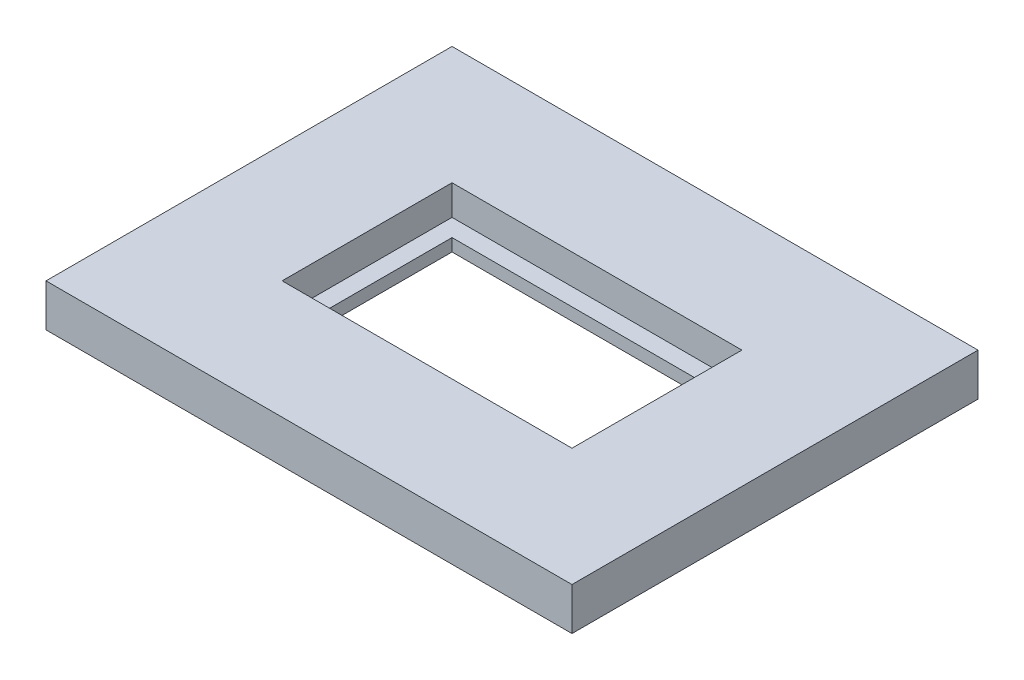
ISO-10303-21;
HEADER;
FILE_DESCRIPTION(('STEP AP214'),'2;1');
FILE_NAME('part.step','',(''),(''),'','','');
FILE_SCHEMA(('AUTOMOTIVE_DESIGN { 1 0 10303 214 1 1 1 1 }'));
ENDSEC;
DATA;
#1=APPLICATION_CONTEXT('core data for automotive mechanical design processes');
#2=APPLICATION_PROTOCOL_DEFINITION('international standard','automotive_design',2000,#1);
#3=PRODUCT_CONTEXT('',#1,'mechanical');
#4=PRODUCT('Part','Part','',(#3));
#5=PRODUCT_RELATED_PRODUCT_CATEGORY('part','',(#4));
#6=PRODUCT_DEFINITION_FORMATION('','',#4);
#7=PRODUCT_DEFINITION_CONTEXT('part definition',#1,'design');
#8=PRODUCT_DEFINITION('design','',#6,#7);
#9=PRODUCT_DEFINITION_SHAPE('','',#8);
#10=(LENGTH_UNIT() NAMED_UNIT(*) SI_UNIT(.MILLI.,.METRE.));
#11=(NAMED_UNIT(*) PLANE_ANGLE_UNIT() SI_UNIT($,.RADIAN.));
#12=(NAMED_UNIT(*) SI_UNIT($,.STERADIAN.) SOLID_ANGLE_UNIT());
#13=UNCERTAINTY_MEASURE_WITH_UNIT(LENGTH_MEASURE(1.E-05),#10,'distance_accuracy_value','');
#14=(GEOMETRIC_REPRESENTATION_CONTEXT(3) GLOBAL_UNCERTAINTY_ASSIGNED_CONTEXT((#13)) GLOBAL_UNIT_ASSIGNED_CONTEXT((#10,
#11,#12)) REPRESENTATION_CONTEXT('',''));
#15=CARTESIAN_POINT('',(0.,0.,0.));
#16=DIRECTION('',(0.,0.,1.));
#17=DIRECTION('',(1.,0.,0.));
#18=AXIS2_PLACEMENT_3D('',#15,#16,#17);
#19=CARTESIAN_POINT('',(0.,19.05,0.));
#20=DIRECTION('',(0.,1.,0.));
#21=DIRECTION('',(0.,0.,1.));
#22=AXIS2_PLACEMENT_3D('',#19,#20,#21);
#23=PLANE('',#22);
#24=DIRECTION('',(0.,0.,1.));
#25=VECTOR('',#24,1.);
#26=CARTESIAN_POINT('',(-167.075,19.05,128.975));
#27=LINE('',#26,#25);
#28=CARTESIAN_POINT('',(-167.075,19.05,-128.975));
#29=VERTEX_POINT('',#28);
#30=CARTESIAN_POINT('',(-167.075,19.05,128.975));
#31=VERTEX_POINT('',#30);
#32=EDGE_CURVE('E206',#29,#31,#27,.T.);
#33=ORIENTED_EDGE('',*,*,#32,.T.);
#34=DIRECTION('',(1.,0.,0.));
#35=VECTOR('',#34,1.);
#36=CARTESIAN_POINT('',(167.075,19.05,128.975));
#37=LINE('',#36,#35);
#38=CARTESIAN_POINT('',(167.075,19.05,128.975));
#39=VERTEX_POINT('',#38);
#40=EDGE_CURVE('E208',#31,#39,#37,.T.);
#41=ORIENTED_EDGE('',*,*,#40,.T.);
#42=DIRECTION('',(0.,0.,-1.));
#43=VECTOR('',#42,1.);
#44=CARTESIAN_POINT('',(167.075,19.05,128.975));
#45=LINE('',#44,#43);
#46=CARTESIAN_POINT('',(167.075,19.05,-128.975));
#47=VERTEX_POINT('',#46);
#48=EDGE_CURVE('E210',#39,#47,#45,.T.);
#49=ORIENTED_EDGE('',*,*,#48,.T.);
#50=DIRECTION('',(-1.,0.,0.));
#51=VECTOR('',#50,1.);
#52=CARTESIAN_POINT('',(167.075,19.05,-128.975));
#53=LINE('',#52,#51);
#54=EDGE_CURVE('E58',#47,#29,#53,.T.);
#55=ORIENTED_EDGE('',*,*,#54,.T.);
#56=EDGE_LOOP('',(#33,#41,#49,#55));
#57=FACE_BOUND('',#56,.T.);
#58=DIRECTION('',(1.,0.,0.));
#59=VECTOR('',#58,1.);
#60=CARTESIAN_POINT('',(92.075,19.05,53.975));
#61=LINE('',#60,#59);
#62=CARTESIAN_POINT('',(-92.075,19.05,53.975));
#63=VERTEX_POINT('',#62);
#64=CARTESIAN_POINT('',(92.075,19.05,53.975));
#65=VERTEX_POINT('',#64);
#66=EDGE_CURVE('E181',#63,#65,#61,.T.);
#67=ORIENTED_EDGE('',*,*,#66,.F.);
#68=DIRECTION('',(0.,0.,1.));
#69=VECTOR('',#68,1.);
#70=CARTESIAN_POINT('',(-92.075,19.05,53.975));
#71=LINE('',#70,#69);
#72=CARTESIAN_POINT('',(-92.075,19.05,-53.975));
#73=VERTEX_POINT('',#72);
#74=EDGE_CURVE('E179',#73,#63,#71,.T.);
#75=ORIENTED_EDGE('',*,*,#74,.F.);
#76=DIRECTION('',(-1.,0.,0.));
#77=VECTOR('',#76,1.);
#78=CARTESIAN_POINT('',(92.075,19.05,-53.975));
#79=LINE('',#78,#77);
#80=CARTESIAN_POINT('',(92.075,19.05,-53.975));
#81=VERTEX_POINT('',#80);
#82=EDGE_CURVE('E186',#81,#73,#79,.T.);
#83=ORIENTED_EDGE('',*,*,#82,.F.);
#84=DIRECTION('',(0.,0.,-1.));
#85=VECTOR('',#84,1.);
#86=CARTESIAN_POINT('',(92.075,19.05,53.975));
#87=LINE('',#86,#85);
#88=EDGE_CURVE('E184',#65,#81,#87,.T.);
#89=ORIENTED_EDGE('',*,*,#88,.F.);
#90=EDGE_LOOP('',(#67,#75,#83,#89));
#91=FACE_BOUND('',#90,.T.);
#92=ADVANCED_FACE('F35',(#57,#91),#23,.T.);
#93=CARTESIAN_POINT('',(-167.075,19.05,128.975));
#94=DIRECTION('',(1.,0.,0.));
#95=DIRECTION('',(0.,0.,-1.));
#96=AXIS2_PLACEMENT_3D('',#93,#94,#95);
#97=PLANE('',#96);
#98=DIRECTION('',(0.,-1.,0.));
#99=VECTOR('',#98,1.);
#100=CARTESIAN_POINT('',(-167.075,19.05,-128.975));
#101=LINE('',#100,#99);
#102=CARTESIAN_POINT('',(-167.075,-7.9375,-128.975));
#103=VERTEX_POINT('',#102);
#104=EDGE_CURVE('E213',#29,#103,#101,.T.);
#105=ORIENTED_EDGE('',*,*,#104,.T.);
#106=DIRECTION('',(0.,0.,-1.));
#107=VECTOR('',#106,1.);
#108=CARTESIAN_POINT('',(-167.075,-7.9375,128.975));
#109=LINE('',#108,#107);
#110=CARTESIAN_POINT('',(-167.075,-7.9375,128.975));
#111=VERTEX_POINT('',#110);
#112=EDGE_CURVE('E143',#111,#103,#109,.T.);
#113=ORIENTED_EDGE('',*,*,#112,.F.);
#114=DIRECTION('',(0.,-1.,0.));
#115=VECTOR('',#114,1.);
#116=CARTESIAN_POINT('',(-167.075,19.05,128.975));
#117=LINE('',#116,#115);
#118=EDGE_CURVE('E11',#31,#111,#117,.T.);
#119=ORIENTED_EDGE('',*,*,#118,.F.);
#120=ORIENTED_EDGE('',*,*,#32,.F.);
#121=EDGE_LOOP('',(#105,#113,#119,#120));
#122=FACE_BOUND('',#121,.T.);
#123=ADVANCED_FACE('F37',(#122),#97,.F.);
#124=CARTESIAN_POINT('',(167.075,19.05,128.975));
#125=DIRECTION('',(0.,0.,-1.));
#126=DIRECTION('',(-1.,0.,0.));
#127=AXIS2_PLACEMENT_3D('',#124,#125,#126);
#128=PLANE('',#127);
#129=ORIENTED_EDGE('',*,*,#118,.T.);
#130=DIRECTION('',(-1.,0.,0.));
#131=VECTOR('',#130,1.);
#132=CARTESIAN_POINT('',(-167.075,-7.9375,128.975));
#133=LINE('',#132,#131);
#134=CARTESIAN_POINT('',(167.075,-7.9375,128.975));
#135=VERTEX_POINT('',#134);
#136=EDGE_CURVE('E175',#135,#111,#133,.T.);
#137=ORIENTED_EDGE('',*,*,#136,.F.);
#138=DIRECTION('',(0.,-1.,0.));
#139=VECTOR('',#138,1.);
#140=CARTESIAN_POINT('',(167.075,19.05,128.975));
#141=LINE('',#140,#139);
#142=EDGE_CURVE('E43',#39,#135,#141,.T.);
#143=ORIENTED_EDGE('',*,*,#142,.F.);
#144=ORIENTED_EDGE('',*,*,#40,.F.);
#145=EDGE_LOOP('',(#129,#137,#143,#144));
#146=FACE_BOUND('',#145,.T.);
#147=ADVANCED_FACE('F227',(#146),#128,.F.);
#148=CARTESIAN_POINT('',(167.075,19.05,128.975));
#149=DIRECTION('',(-1.,0.,0.));
#150=DIRECTION('',(0.,0.,1.));
#151=AXIS2_PLACEMENT_3D('',#148,#149,#150);
#152=PLANE('',#151);
#153=ORIENTED_EDGE('',*,*,#142,.T.);
#154=DIRECTION('',(0.,0.,1.));
#155=VECTOR('',#154,1.);
#156=CARTESIAN_POINT('',(167.075,-7.9375,128.975));
#157=LINE('',#156,#155);
#158=CARTESIAN_POINT('',(167.075,-7.9375,-128.975));
#159=VERTEX_POINT('',#158);
#160=EDGE_CURVE('E172',#159,#135,#157,.T.);
#161=ORIENTED_EDGE('',*,*,#160,.F.);
#162=DIRECTION('',(0.,-1.,0.));
#163=VECTOR('',#162,1.);
#164=CARTESIAN_POINT('',(167.075,19.05,-128.975));
#165=LINE('',#164,#163);
#166=EDGE_CURVE('E215',#47,#159,#165,.T.);
#167=ORIENTED_EDGE('',*,*,#166,.F.);
#168=ORIENTED_EDGE('',*,*,#48,.F.);
#169=EDGE_LOOP('',(#153,#161,#167,#168));
#170=FACE_BOUND('',#169,.T.);
#171=ADVANCED_FACE('F220',(#170),#152,.F.);
#172=CARTESIAN_POINT('',(167.075,19.05,-128.975));
#173=DIRECTION('',(0.,0.,1.));
#174=DIRECTION('',(1.,0.,0.));
#175=AXIS2_PLACEMENT_3D('',#172,#173,#174);
#176=PLANE('',#175);
#177=ORIENTED_EDGE('',*,*,#166,.T.);
#178=DIRECTION('',(1.,0.,0.));
#179=VECTOR('',#178,1.);
#180=CARTESIAN_POINT('',(-167.075,-7.9375,-128.975));
#181=LINE('',#180,#179);
#182=EDGE_CURVE('E169',#103,#159,#181,.T.);
#183=ORIENTED_EDGE('',*,*,#182,.F.);
#184=ORIENTED_EDGE('',*,*,#104,.F.);
#185=ORIENTED_EDGE('',*,*,#54,.F.);
#186=EDGE_LOOP('',(#177,#183,#184,#185));
#187=FACE_BOUND('',#186,.T.);
#188=ADVANCED_FACE('F232',(#187),#176,.F.);
#189=CARTESIAN_POINT('',(-92.075,19.05,53.975));
#190=DIRECTION('',(1.,0.,0.));
#191=DIRECTION('',(0.,0.,-1.));
#192=AXIS2_PLACEMENT_3D('',#189,#190,#191);
#193=PLANE('',#192);
#194=DIRECTION('',(0.,0.,1.));
#195=VECTOR('',#194,1.);
#196=CARTESIAN_POINT('',(-92.075,0.,53.975));
#197=LINE('',#196,#195);
#198=CARTESIAN_POINT('',(-92.075,0.,-53.975));
#199=VERTEX_POINT('',#198);
#200=CARTESIAN_POINT('',(-92.075,0.,53.975));
#201=VERTEX_POINT('',#200);
#202=EDGE_CURVE('E178',#199,#201,#197,.T.);
#203=ORIENTED_EDGE('',*,*,#202,.F.);
#204=DIRECTION('',(0.,-1.,0.));
#205=VECTOR('',#204,1.);
#206=CARTESIAN_POINT('',(-92.075,19.05,-53.975));
#207=LINE('',#206,#205);
#208=EDGE_CURVE('E188',#73,#199,#207,.T.);
#209=ORIENTED_EDGE('',*,*,#208,.F.);
#210=ORIENTED_EDGE('',*,*,#74,.T.);
#211=DIRECTION('',(0.,-1.,0.));
#212=VECTOR('',#211,1.);
#213=CARTESIAN_POINT('',(-92.075,19.05,53.975));
#214=LINE('',#213,#212);
#215=EDGE_CURVE('E203',#63,#201,#214,.T.);
#216=ORIENTED_EDGE('',*,*,#215,.T.);
#217=EDGE_LOOP('',(#203,#209,#210,#216));
#218=FACE_BOUND('',#217,.T.);
#219=ADVANCED_FACE('F234',(#218),#193,.T.);
#220=CARTESIAN_POINT('',(92.075,19.05,53.975));
#221=DIRECTION('',(0.,0.,-1.));
#222=DIRECTION('',(-1.,0.,0.));
#223=AXIS2_PLACEMENT_3D('',#220,#221,#222);
#224=PLANE('',#223);
#225=DIRECTION('',(1.,0.,0.));
#226=VECTOR('',#225,1.);
#227=CARTESIAN_POINT('',(92.075,0.,53.975));
#228=LINE('',#227,#226);
#229=CARTESIAN_POINT('',(92.075,0.,53.975));
#230=VERTEX_POINT('',#229);
#231=EDGE_CURVE('E191',#201,#230,#228,.T.);
#232=ORIENTED_EDGE('',*,*,#231,.F.);
#233=ORIENTED_EDGE('',*,*,#215,.F.);
#234=ORIENTED_EDGE('',*,*,#66,.T.);
#235=DIRECTION('',(0.,-1.,0.));
#236=VECTOR('',#235,1.);
#237=CARTESIAN_POINT('',(92.075,19.05,53.975));
#238=LINE('',#237,#236);
#239=EDGE_CURVE('E201',#65,#230,#238,.T.);
#240=ORIENTED_EDGE('',*,*,#239,.T.);
#241=EDGE_LOOP('',(#232,#233,#234,#240));
#242=FACE_BOUND('',#241,.T.);
#243=ADVANCED_FACE('F240',(#242),#224,.T.);
#244=CARTESIAN_POINT('',(92.075,19.05,53.975));
#245=DIRECTION('',(-1.,0.,0.));
#246=DIRECTION('',(0.,0.,1.));
#247=AXIS2_PLACEMENT_3D('',#244,#245,#246);
#248=PLANE('',#247);
#249=DIRECTION('',(0.,0.,-1.));
#250=VECTOR('',#249,1.);
#251=CARTESIAN_POINT('',(92.075,0.,53.975));
#252=LINE('',#251,#250);
#253=CARTESIAN_POINT('',(92.075,0.,-53.975));
#254=VERTEX_POINT('',#253);
#255=EDGE_CURVE('E194',#230,#254,#252,.T.);
#256=ORIENTED_EDGE('',*,*,#255,.F.);
#257=ORIENTED_EDGE('',*,*,#239,.F.);
#258=ORIENTED_EDGE('',*,*,#88,.T.);
#259=DIRECTION('',(0.,-1.,0.));
#260=VECTOR('',#259,1.);
#261=CARTESIAN_POINT('',(92.075,19.05,-53.975));
#262=LINE('',#261,#260);
#263=EDGE_CURVE('E50',#81,#254,#262,.T.);
#264=ORIENTED_EDGE('',*,*,#263,.T.);
#265=EDGE_LOOP('',(#256,#257,#258,#264));
#266=FACE_BOUND('',#265,.T.);
#267=ADVANCED_FACE('F253',(#266),#248,.T.);
#268=CARTESIAN_POINT('',(92.075,19.05,-53.975));
#269=DIRECTION('',(0.,0.,1.));
#270=DIRECTION('',(1.,0.,0.));
#271=AXIS2_PLACEMENT_3D('',#268,#269,#270);
#272=PLANE('',#271);
#273=DIRECTION('',(-1.,0.,0.));
#274=VECTOR('',#273,1.);
#275=CARTESIAN_POINT('',(92.075,0.,-53.975));
#276=LINE('',#275,#274);
#277=EDGE_CURVE('E182',#254,#199,#276,.T.);
#278=ORIENTED_EDGE('',*,*,#277,.F.);
#279=ORIENTED_EDGE('',*,*,#263,.F.);
#280=ORIENTED_EDGE('',*,*,#82,.T.);
#281=ORIENTED_EDGE('',*,*,#208,.T.);
#282=EDGE_LOOP('',(#278,#279,#280,#281));
#283=FACE_BOUND('',#282,.T.);
#284=ADVANCED_FACE('F257',(#283),#272,.T.);
#285=CARTESIAN_POINT('',(0.,-7.9375,0.));
#286=DIRECTION('',(0.,-1.,0.));
#287=DIRECTION('',(0.,0.,-1.));
#288=AXIS2_PLACEMENT_3D('',#285,#286,#287);
#289=PLANE('',#288);
#290=ORIENTED_EDGE('',*,*,#112,.T.);
#291=ORIENTED_EDGE('',*,*,#182,.T.);
#292=ORIENTED_EDGE('',*,*,#160,.T.);
#293=ORIENTED_EDGE('',*,*,#136,.T.);
#294=EDGE_LOOP('',(#290,#291,#292,#293));
#295=FACE_BOUND('',#294,.T.);
#296=DIRECTION('',(0.,0.,-1.));
#297=VECTOR('',#296,1.);
#298=CARTESIAN_POINT('',(-80.9625,-7.9375,42.8625));
#299=LINE('',#298,#297);
#300=CARTESIAN_POINT('',(-80.9625,-7.9375,42.8625));
#301=VERTEX_POINT('',#300);
#302=CARTESIAN_POINT('',(-80.9625,-7.9375,-42.8625));
#303=VERTEX_POINT('',#302);
#304=EDGE_CURVE('E135',#301,#303,#299,.T.);
#305=ORIENTED_EDGE('',*,*,#304,.F.);
#306=DIRECTION('',(-1.,0.,0.));
#307=VECTOR('',#306,1.);
#308=CARTESIAN_POINT('',(-80.9625,-7.9375,42.8625));
#309=LINE('',#308,#307);
#310=CARTESIAN_POINT('',(80.9625,-7.9375,42.8625));
#311=VERTEX_POINT('',#310);
#312=EDGE_CURVE('E125',#311,#301,#309,.T.);
#313=ORIENTED_EDGE('',*,*,#312,.F.);
#314=DIRECTION('',(0.,0.,1.));
#315=VECTOR('',#314,1.);
#316=CARTESIAN_POINT('',(80.9625,-7.9375,42.8625));
#317=LINE('',#316,#315);
#318=CARTESIAN_POINT('',(80.9625,-7.9375,-42.8625));
#319=VERTEX_POINT('',#318);
#320=EDGE_CURVE('E151',#319,#311,#317,.T.);
#321=ORIENTED_EDGE('',*,*,#320,.F.);
#322=DIRECTION('',(1.,0.,0.));
#323=VECTOR('',#322,1.);
#324=CARTESIAN_POINT('',(-80.9625,-7.9375,-42.8625));
#325=LINE('',#324,#323);
#326=EDGE_CURVE('E149',#303,#319,#325,.T.);
#327=ORIENTED_EDGE('',*,*,#326,.F.);
#328=EDGE_LOOP('',(#305,#313,#321,#327));
#329=FACE_BOUND('',#328,.T.);
#330=ADVANCED_FACE('F147',(#295,#329),#289,.T.);
#331=CARTESIAN_POINT('',(0.,0.,0.));
#332=DIRECTION('',(0.,-1.,0.));
#333=DIRECTION('',(0.,0.,-1.));
#334=AXIS2_PLACEMENT_3D('',#331,#332,#333);
#335=PLANE('',#334);
#336=ORIENTED_EDGE('',*,*,#202,.T.);
#337=ORIENTED_EDGE('',*,*,#231,.T.);
#338=ORIENTED_EDGE('',*,*,#255,.T.);
#339=ORIENTED_EDGE('',*,*,#277,.T.);
#340=EDGE_LOOP('',(#336,#337,#338,#339));
#341=FACE_BOUND('',#340,.T.);
#342=DIRECTION('',(-1.,0.,0.));
#343=VECTOR('',#342,1.);
#344=CARTESIAN_POINT('',(-80.9625,0.,42.8625));
#345=LINE('',#344,#343);
#346=CARTESIAN_POINT('',(80.9625,0.,42.8625));
#347=VERTEX_POINT('',#346);
#348=CARTESIAN_POINT('',(-80.9625,0.,42.8625));
#349=VERTEX_POINT('',#348);
#350=EDGE_CURVE('E155',#347,#349,#345,.T.);
#351=ORIENTED_EDGE('',*,*,#350,.T.);
#352=DIRECTION('',(0.,0.,-1.));
#353=VECTOR('',#352,1.);
#354=CARTESIAN_POINT('',(-80.9625,0.,42.8625));
#355=LINE('',#354,#353);
#356=CARTESIAN_POINT('',(-80.9625,0.,-42.8625));
#357=VERTEX_POINT('',#356);
#358=EDGE_CURVE('E142',#349,#357,#355,.T.);
#359=ORIENTED_EDGE('',*,*,#358,.T.);
#360=DIRECTION('',(1.,0.,0.));
#361=VECTOR('',#360,1.);
#362=CARTESIAN_POINT('',(-80.9625,0.,-42.8625));
#363=LINE('',#362,#361);
#364=CARTESIAN_POINT('',(80.9625,0.,-42.8625));
#365=VERTEX_POINT('',#364);
#366=EDGE_CURVE('E158',#357,#365,#363,.T.);
#367=ORIENTED_EDGE('',*,*,#366,.T.);
#368=DIRECTION('',(0.,0.,1.));
#369=VECTOR('',#368,1.);
#370=CARTESIAN_POINT('',(80.9625,0.,42.8625));
#371=LINE('',#370,#369);
#372=EDGE_CURVE('E136',#365,#347,#371,.T.);
#373=ORIENTED_EDGE('',*,*,#372,.T.);
#374=EDGE_LOOP('',(#351,#359,#367,#373));
#375=FACE_BOUND('',#374,.T.);
#376=ADVANCED_FACE('F261',(#341,#375),#335,.F.);
#377=CARTESIAN_POINT('',(-80.9625,-7.9375,42.8625));
#378=DIRECTION('',(0.,0.,-1.));
#379=DIRECTION('',(-1.,0.,0.));
#380=AXIS2_PLACEMENT_3D('',#377,#378,#379);
#381=PLANE('',#380);
#382=ORIENTED_EDGE('',*,*,#350,.F.);
#383=DIRECTION('',(0.,1.,0.));
#384=VECTOR('',#383,1.);
#385=CARTESIAN_POINT('',(80.9625,-7.9375,42.8625));
#386=LINE('',#385,#384);
#387=EDGE_CURVE('E131',#311,#347,#386,.T.);
#388=ORIENTED_EDGE('',*,*,#387,.F.);
#389=ORIENTED_EDGE('',*,*,#312,.T.);
#390=DIRECTION('',(0.,1.,0.));
#391=VECTOR('',#390,1.);
#392=CARTESIAN_POINT('',(-80.9625,-7.9375,42.8625));
#393=LINE('',#392,#391);
#394=EDGE_CURVE('E128',#301,#349,#393,.T.);
#395=ORIENTED_EDGE('',*,*,#394,.T.);
#396=EDGE_LOOP('',(#382,#388,#389,#395));
#397=FACE_BOUND('',#396,.T.);
#398=ADVANCED_FACE('F127',(#397),#381,.T.);
#399=CARTESIAN_POINT('',(-80.9625,-7.9375,42.8625));
#400=DIRECTION('',(1.,0.,0.));
#401=DIRECTION('',(0.,0.,-1.));
#402=AXIS2_PLACEMENT_3D('',#399,#400,#401);
#403=PLANE('',#402);
#404=ORIENTED_EDGE('',*,*,#358,.F.);
#405=ORIENTED_EDGE('',*,*,#394,.F.);
#406=ORIENTED_EDGE('',*,*,#304,.T.);
#407=DIRECTION('',(0.,1.,0.));
#408=VECTOR('',#407,1.);
#409=CARTESIAN_POINT('',(-80.9625,-7.9375,-42.8625));
#410=LINE('',#409,#408);
#411=EDGE_CURVE('E144',#303,#357,#410,.T.);
#412=ORIENTED_EDGE('',*,*,#411,.T.);
#413=EDGE_LOOP('',(#404,#405,#406,#412));
#414=FACE_BOUND('',#413,.T.);
#415=ADVANCED_FACE('F139',(#414),#403,.T.);
#416=CARTESIAN_POINT('',(-80.9625,-7.9375,-42.8625));
#417=DIRECTION('',(0.,0.,1.));
#418=DIRECTION('',(1.,0.,0.));
#419=AXIS2_PLACEMENT_3D('',#416,#417,#418);
#420=PLANE('',#419);
#421=ORIENTED_EDGE('',*,*,#366,.F.);
#422=ORIENTED_EDGE('',*,*,#411,.F.);
#423=ORIENTED_EDGE('',*,*,#326,.T.);
#424=DIRECTION('',(0.,1.,0.));
#425=VECTOR('',#424,1.);
#426=CARTESIAN_POINT('',(80.9625,-7.9375,-42.8625));
#427=LINE('',#426,#425);
#428=EDGE_CURVE('E164',#319,#365,#427,.T.);
#429=ORIENTED_EDGE('',*,*,#428,.T.);
#430=EDGE_LOOP('',(#421,#422,#423,#429));
#431=FACE_BOUND('',#430,.T.);
#432=ADVANCED_FACE('F271',(#431),#420,.T.);
#433=CARTESIAN_POINT('',(80.9625,-7.9375,42.8625));
#434=DIRECTION('',(-1.,0.,0.));
#435=DIRECTION('',(0.,0.,1.));
#436=AXIS2_PLACEMENT_3D('',#433,#434,#435);
#437=PLANE('',#436);
#438=ORIENTED_EDGE('',*,*,#372,.F.);
#439=ORIENTED_EDGE('',*,*,#428,.F.);
#440=ORIENTED_EDGE('',*,*,#320,.T.);
#441=ORIENTED_EDGE('',*,*,#387,.T.);
#442=EDGE_LOOP('',(#438,#439,#440,#441));
#443=FACE_BOUND('',#442,.T.);
#444=ADVANCED_FACE('F274',(#443),#437,.T.);
#445=CLOSED_SHELL('',(#92,#123,#147,#171,#188,#219,#243,#267,#284,#330,#376,#398,#415,#432,#444));
#446=MANIFOLD_SOLID_BREP('B2',#445);
#447=ADVANCED_BREP_SHAPE_REPRESENTATION('',(#18,#446),#14);
#448=SHAPE_DEFINITION_REPRESENTATION(#9,#447);
ENDSEC;
END-ISO-10303-21;
